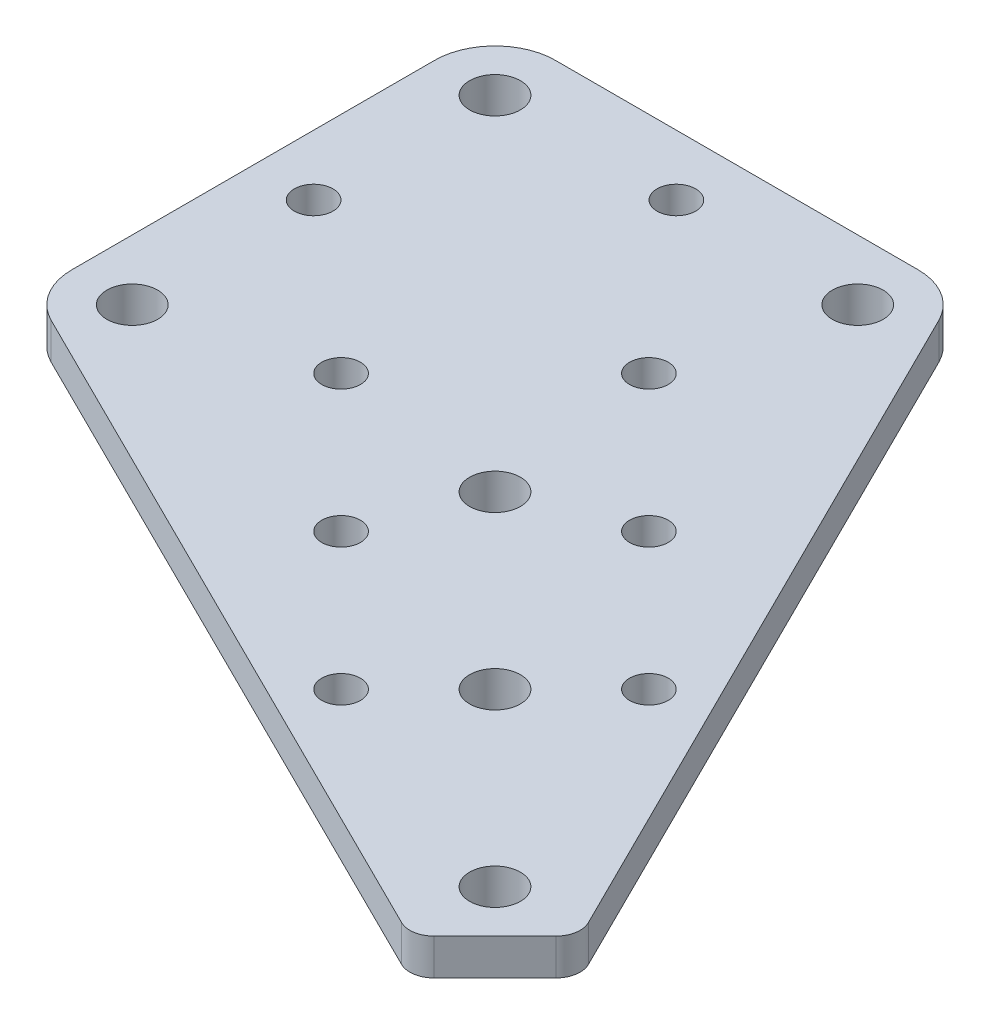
ISO-10303-21;
HEADER;
FILE_DESCRIPTION(('STEP AP214'),'2;1');
FILE_NAME('part.step','',(''),(''),'','','');
FILE_SCHEMA(('AUTOMOTIVE_DESIGN { 1 0 10303 214 1 1 1 1 }'));
ENDSEC;
DATA;
#1=APPLICATION_CONTEXT('core data for automotive mechanical design processes');
#2=APPLICATION_PROTOCOL_DEFINITION('international standard','automotive_design',2000,#1);
#3=PRODUCT_CONTEXT('',#1,'mechanical');
#4=PRODUCT('Part','Part','',(#3));
#5=PRODUCT_RELATED_PRODUCT_CATEGORY('part','',(#4));
#6=PRODUCT_DEFINITION_FORMATION('','',#4);
#7=PRODUCT_DEFINITION_CONTEXT('part definition',#1,'design');
#8=PRODUCT_DEFINITION('design','',#6,#7);
#9=PRODUCT_DEFINITION_SHAPE('','',#8);
#10=(LENGTH_UNIT() NAMED_UNIT(*) SI_UNIT(.MILLI.,.METRE.));
#11=(NAMED_UNIT(*) PLANE_ANGLE_UNIT() SI_UNIT($,.RADIAN.));
#12=(NAMED_UNIT(*) SI_UNIT($,.STERADIAN.) SOLID_ANGLE_UNIT());
#13=UNCERTAINTY_MEASURE_WITH_UNIT(LENGTH_MEASURE(1.E-05),#10,'distance_accuracy_value','');
#14=(GEOMETRIC_REPRESENTATION_CONTEXT(3) GLOBAL_UNCERTAINTY_ASSIGNED_CONTEXT((#13)) GLOBAL_UNIT_ASSIGNED_CONTEXT((#10,
#11,#12)) REPRESENTATION_CONTEXT('',''));
#15=CARTESIAN_POINT('',(0.,0.,0.));
#16=DIRECTION('',(0.,0.,1.));
#17=DIRECTION('',(1.,0.,0.));
#18=AXIS2_PLACEMENT_3D('',#15,#16,#17);
#19=CARTESIAN_POINT('',(13.,3.,43.));
#20=DIRECTION('',(0.,1.,0.));
#21=DIRECTION('',(0.,0.,1.));
#22=AXIS2_PLACEMENT_3D('',#19,#20,#21);
#23=PLANE('',#22);
#24=CARTESIAN_POINT('',(39.2821792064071,3.,26.5542571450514));
#25=DIRECTION('',(0.,1.,0.));
#26=DIRECTION('',(0.,0.,1.));
#27=AXIS2_PLACEMENT_3D('',#24,#25,#26);
#28=CIRCLE('',#27,1.6);
#29=CARTESIAN_POINT('',(39.2821792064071,3.,28.1542571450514));
#30=VERTEX_POINT('',#29);
#31=EDGE_CURVE('E432',#30,#30,#28,.T.);
#32=ORIENTED_EDGE('',*,*,#31,.F.);
#33=EDGE_LOOP('',(#32));
#34=FACE_BOUND('',#33,.T.);
#35=CARTESIAN_POINT('',(26.5542571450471,3.,39.2821792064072));
#36=DIRECTION('',(0.,1.,0.));
#37=DIRECTION('',(0.,0.,1.));
#38=AXIS2_PLACEMENT_3D('',#35,#36,#37);
#39=CIRCLE('',#38,1.6);
#40=CARTESIAN_POINT('',(26.5542571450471,3.,40.8821792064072));
#41=VERTEX_POINT('',#40);
#42=EDGE_CURVE('E452',#41,#41,#39,.T.);
#43=ORIENTED_EDGE('',*,*,#42,.F.);
#44=EDGE_LOOP('',(#43));
#45=FACE_BOUND('',#44,.T.);
#46=CARTESIAN_POINT('',(13.,3.,13.));
#47=DIRECTION('',(0.,1.,0.));
#48=DIRECTION('',(0.,0.,1.));
#49=AXIS2_PLACEMENT_3D('',#46,#47,#48);
#50=CIRCLE('',#49,2.1);
#51=CARTESIAN_POINT('',(13.,3.,15.1));
#52=VERTEX_POINT('',#51);
#53=EDGE_CURVE('E464',#52,#52,#50,.T.);
#54=ORIENTED_EDGE('',*,*,#53,.F.);
#55=EDGE_LOOP('',(#54));
#56=FACE_BOUND('',#55,.T.);
#57=CARTESIAN_POINT('',(55.5456351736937,3.,55.545635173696));
#58=DIRECTION('',(0.,1.,0.));
#59=DIRECTION('',(0.,0.,1.));
#60=AXIS2_PLACEMENT_3D('',#57,#58,#59);
#61=CIRCLE('',#60,2.10000000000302);
#62=CARTESIAN_POINT('',(55.5456351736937,3.,57.645635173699));
#63=VERTEX_POINT('',#62);
#64=EDGE_CURVE('E476',#63,#63,#61,.T.);
#65=ORIENTED_EDGE('',*,*,#64,.F.);
#66=EDGE_LOOP('',(#65));
#67=FACE_BOUND('',#66,.T.);
#68=CARTESIAN_POINT('',(49.1816741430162,3.,61.909596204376));
#69=DIRECTION('',(0.,1.,0.));
#70=DIRECTION('',(0.,0.,1.));
#71=AXIS2_PLACEMENT_3D('',#68,#69,#70);
#72=CIRCLE('',#71,1.60000000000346);
#73=CARTESIAN_POINT('',(49.1816741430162,3.,63.5095962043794));
#74=VERTEX_POINT('',#73);
#75=EDGE_CURVE('E488',#74,#74,#72,.T.);
#76=ORIENTED_EDGE('',*,*,#75,.F.);
#77=EDGE_LOOP('',(#76));
#78=FACE_BOUND('',#77,.T.);
#79=CARTESIAN_POINT('',(13.,3.,43.));
#80=DIRECTION('',(0.,1.,0.));
#81=DIRECTION('',(0.,0.,1.));
#82=AXIS2_PLACEMENT_3D('',#79,#80,#81);
#83=CIRCLE('',#82,2.1);
#84=CARTESIAN_POINT('',(13.,3.,45.1));
#85=VERTEX_POINT('',#84);
#86=EDGE_CURVE('E500',#85,#85,#83,.T.);
#87=ORIENTED_EDGE('',*,*,#86,.F.);
#88=EDGE_LOOP('',(#87));
#89=FACE_BOUND('',#88,.T.);
#90=CARTESIAN_POINT('',(43.,3.,13.));
#91=DIRECTION('',(0.,1.,0.));
#92=DIRECTION('',(0.,0.,1.));
#93=AXIS2_PLACEMENT_3D('',#90,#91,#92);
#94=CIRCLE('',#93,2.1);
#95=CARTESIAN_POINT('',(43.,3.,15.1));
#96=VERTEX_POINT('',#95);
#97=EDGE_CURVE('E160',#96,#96,#94,.T.);
#98=ORIENTED_EDGE('',*,*,#97,.F.);
#99=EDGE_LOOP('',(#98));
#100=FACE_BOUND('',#99,.T.);
#101=DIRECTION('',(0.707106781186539,0.,-0.707106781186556));
#102=VECTOR('',#101,1.);
#103=CARTESIAN_POINT('',(76.7588386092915,3.,69.6877707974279));
#104=LINE('',#103,#102);
#105=CARTESIAN_POINT('',(70.7045211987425,3.,75.7420882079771));
#106=VERTEX_POINT('',#105);
#107=CARTESIAN_POINT('',(75.7420882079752,3.,70.7045211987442));
#108=VERTEX_POINT('',#107);
#109=EDGE_CURVE('E129',#106,#108,#104,.T.);
#110=ORIENTED_EDGE('',*,*,#109,.T.);
#111=CARTESIAN_POINT('',(74.3278746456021,3.,69.2903076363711));
#112=DIRECTION('',(0.,1.,0.));
#113=DIRECTION('',(0.,0.,1.));
#114=AXIS2_PLACEMENT_3D('',#111,#112,#113);
#115=CIRCLE('',#114,2.);
#116=CARTESIAN_POINT('',(76.1188544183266,3.,68.4001439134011));
#117=VERTEX_POINT('',#116);
#118=EDGE_CURVE('E49',#108,#117,#115,.T.);
#119=ORIENTED_EDGE('',*,*,#118,.T.);
#120=DIRECTION('',(-0.445081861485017,0.,-0.895489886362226));
#121=VECTOR('',#120,1.);
#122=CARTESIAN_POINT('',(47.4774494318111,3.,10.7745906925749));
#123=LINE('',#122,#121);
#124=CARTESIAN_POINT('',(47.4774494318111,3.,10.7745906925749));
#125=VERTEX_POINT('',#124);
#126=EDGE_CURVE('E119',#117,#125,#123,.T.);
#127=ORIENTED_EDGE('',*,*,#126,.T.);
#128=CARTESIAN_POINT('',(43.,3.,13.));
#129=DIRECTION('',(0.,1.,0.));
#130=DIRECTION('',(0.,0.,-1.));
#131=AXIS2_PLACEMENT_3D('',#128,#129,#130);
#132=CIRCLE('',#131,5.);
#133=CARTESIAN_POINT('',(43.,3.,8.));
#134=VERTEX_POINT('',#133);
#135=EDGE_CURVE('E123',#125,#134,#132,.T.);
#136=ORIENTED_EDGE('',*,*,#135,.T.);
#137=DIRECTION('',(-1.,0.,0.));
#138=VECTOR('',#137,1.);
#139=CARTESIAN_POINT('',(13.,3.,8.));
#140=LINE('',#139,#138);
#141=CARTESIAN_POINT('',(13.,3.,8.));
#142=VERTEX_POINT('',#141);
#143=EDGE_CURVE('E144',#134,#142,#140,.T.);
#144=ORIENTED_EDGE('',*,*,#143,.T.);
#145=CARTESIAN_POINT('',(13.,3.,13.));
#146=DIRECTION('',(0.,1.,0.));
#147=DIRECTION('',(0.,0.,-1.));
#148=AXIS2_PLACEMENT_3D('',#145,#146,#147);
#149=CIRCLE('',#148,5.);
#150=CARTESIAN_POINT('',(8.00000000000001,3.,13.));
#151=VERTEX_POINT('',#150);
#152=EDGE_CURVE('E146',#142,#151,#149,.T.);
#153=ORIENTED_EDGE('',*,*,#152,.T.);
#154=DIRECTION('',(0.,0.,1.));
#155=VECTOR('',#154,1.);
#156=CARTESIAN_POINT('',(8.,3.,43.));
#157=LINE('',#156,#155);
#158=CARTESIAN_POINT('',(8.,3.,43.));
#159=VERTEX_POINT('',#158);
#160=EDGE_CURVE('E151',#151,#159,#157,.T.);
#161=ORIENTED_EDGE('',*,*,#160,.T.);
#162=CARTESIAN_POINT('',(13.,3.,43.));
#163=DIRECTION('',(0.,1.,0.));
#164=DIRECTION('',(0.,0.,1.));
#165=AXIS2_PLACEMENT_3D('',#162,#163,#164);
#166=CIRCLE('',#165,5.00000000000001);
#167=CARTESIAN_POINT('',(10.7745906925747,3.,47.4774494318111));
#168=VERTEX_POINT('',#167);
#169=EDGE_CURVE('E153',#159,#168,#166,.T.);
#170=ORIENTED_EDGE('',*,*,#169,.T.);
#171=DIRECTION('',(0.895489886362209,0.,0.445081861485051));
#172=VECTOR('',#171,1.);
#173=CARTESIAN_POINT('',(69.6877707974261,3.,76.7588386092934));
#174=LINE('',#173,#172);
#175=CARTESIAN_POINT('',(68.4001439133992,3.,76.1188544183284));
#176=VERTEX_POINT('',#175);
#177=EDGE_CURVE('E155',#168,#176,#174,.T.);
#178=ORIENTED_EDGE('',*,*,#177,.T.);
#179=CARTESIAN_POINT('',(69.2903076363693,3.,74.327874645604));
#180=DIRECTION('',(0.,1.,0.));
#181=DIRECTION('',(0.,0.,1.));
#182=AXIS2_PLACEMENT_3D('',#179,#180,#181);
#183=CIRCLE('',#182,2.);
#184=EDGE_CURVE('E195',#176,#106,#183,.T.);
#185=ORIENTED_EDGE('',*,*,#184,.T.);
#186=EDGE_LOOP('',(#110,#119,#127,#136,#144,#153,#161,#170,#178,#185));
#187=FACE_BOUND('',#186,.T.);
#188=CARTESIAN_POINT('',(28.,3.,13.));
#189=DIRECTION('',(0.,1.,0.));
#190=DIRECTION('',(0.,0.,1.));
#191=AXIS2_PLACEMENT_3D('',#188,#189,#190);
#192=CIRCLE('',#191,1.6);
#193=CARTESIAN_POINT('',(28.,3.,14.6));
#194=VERTEX_POINT('',#193);
#195=EDGE_CURVE('E506',#194,#194,#192,.T.);
#196=ORIENTED_EDGE('',*,*,#195,.F.);
#197=EDGE_LOOP('',(#196));
#198=FACE_BOUND('',#197,.T.);
#199=CARTESIAN_POINT('',(13.,3.,28.));
#200=DIRECTION('',(0.,1.,0.));
#201=DIRECTION('',(0.,0.,1.));
#202=AXIS2_PLACEMENT_3D('',#199,#200,#201);
#203=CIRCLE('',#202,1.6);
#204=CARTESIAN_POINT('',(13.,3.,29.6));
#205=VERTEX_POINT('',#204);
#206=EDGE_CURVE('E494',#205,#205,#203,.T.);
#207=ORIENTED_EDGE('',*,*,#206,.F.);
#208=EDGE_LOOP('',(#207));
#209=FACE_BOUND('',#208,.T.);
#210=CARTESIAN_POINT('',(41.4034995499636,3.,41.4034995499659));
#211=DIRECTION('',(0.,1.,0.));
#212=DIRECTION('',(0.,0.,1.));
#213=AXIS2_PLACEMENT_3D('',#210,#211,#212);
#214=CIRCLE('',#213,2.10000000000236);
#215=CARTESIAN_POINT('',(41.4034995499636,3.,43.5034995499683));
#216=VERTEX_POINT('',#215);
#217=EDGE_CURVE('E482',#216,#216,#214,.T.);
#218=ORIENTED_EDGE('',*,*,#217,.F.);
#219=EDGE_LOOP('',(#218));
#220=FACE_BOUND('',#219,.T.);
#221=CARTESIAN_POINT('',(69.6877707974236,3.,69.6877707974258));
#222=DIRECTION('',(0.,1.,0.));
#223=DIRECTION('',(0.,0.,1.));
#224=AXIS2_PLACEMENT_3D('',#221,#222,#223);
#225=CIRCLE('',#224,2.10000000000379);
#226=CARTESIAN_POINT('',(69.6877707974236,3.,71.7877707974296));
#227=VERTEX_POINT('',#226);
#228=EDGE_CURVE('E470',#227,#227,#225,.T.);
#229=ORIENTED_EDGE('',*,*,#228,.F.);
#230=EDGE_LOOP('',(#229));
#231=FACE_BOUND('',#230,.T.);
#232=CARTESIAN_POINT('',(37.8679656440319,3.,50.5958877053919));
#233=DIRECTION('',(0.,1.,0.));
#234=DIRECTION('',(0.,0.,1.));
#235=AXIS2_PLACEMENT_3D('',#232,#233,#234);
#236=CIRCLE('',#235,1.6);
#237=CARTESIAN_POINT('',(37.8679656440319,3.,52.1958877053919));
#238=VERTEX_POINT('',#237);
#239=EDGE_CURVE('E458',#238,#238,#236,.T.);
#240=ORIENTED_EDGE('',*,*,#239,.F.);
#241=EDGE_LOOP('',(#240));
#242=FACE_BOUND('',#241,.T.);
#243=CARTESIAN_POINT('',(50.595887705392,3.,37.8679656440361));
#244=DIRECTION('',(0.,1.,0.));
#245=DIRECTION('',(0.,0.,1.));
#246=AXIS2_PLACEMENT_3D('',#243,#244,#245);
#247=CIRCLE('',#246,1.6);
#248=CARTESIAN_POINT('',(50.595887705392,3.,39.4679656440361));
#249=VERTEX_POINT('',#248);
#250=EDGE_CURVE('E446',#249,#249,#247,.T.);
#251=ORIENTED_EDGE('',*,*,#250,.F.);
#252=EDGE_LOOP('',(#251));
#253=FACE_BOUND('',#252,.T.);
#254=CARTESIAN_POINT('',(61.909596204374,3.,49.1816741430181));
#255=DIRECTION('',(0.,1.,0.));
#256=DIRECTION('',(0.,0.,1.));
#257=AXIS2_PLACEMENT_3D('',#254,#255,#256);
#258=CIRCLE('',#257,1.60000000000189);
#259=CARTESIAN_POINT('',(61.909596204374,3.,50.78167414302));
#260=VERTEX_POINT('',#259);
#261=EDGE_CURVE('E437',#260,#260,#258,.T.);
#262=ORIENTED_EDGE('',*,*,#261,.F.);
#263=EDGE_LOOP('',(#262));
#264=FACE_BOUND('',#263,.T.);
#265=ADVANCED_FACE('F41',(#34,#45,#56,#67,#78,#89,#100,#187,#198,#209,#220,#231,#242,#253,#264),
#23,.T.);
#266=CARTESIAN_POINT('',(13.,0.,43.));
#267=DIRECTION('',(0.,1.,0.));
#268=DIRECTION('',(0.,0.,1.));
#269=AXIS2_PLACEMENT_3D('',#266,#267,#268);
#270=PLANE('',#269);
#271=DIRECTION('',(-0.445081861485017,0.,-0.895489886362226));
#272=VECTOR('',#271,1.);
#273=CARTESIAN_POINT('',(47.4774494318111,0.,10.7745906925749));
#274=LINE('',#273,#272);
#275=CARTESIAN_POINT('',(76.1188544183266,0.,68.4001439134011));
#276=VERTEX_POINT('',#275);
#277=CARTESIAN_POINT('',(47.4774494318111,0.,10.7745906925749));
#278=VERTEX_POINT('',#277);
#279=EDGE_CURVE('E135',#276,#278,#274,.T.);
#280=ORIENTED_EDGE('',*,*,#279,.F.);
#281=CARTESIAN_POINT('',(74.3278746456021,0.,69.2903076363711));
#282=DIRECTION('',(0.,1.,0.));
#283=DIRECTION('',(0.,0.,1.));
#284=AXIS2_PLACEMENT_3D('',#281,#282,#283);
#285=CIRCLE('',#284,2.);
#286=CARTESIAN_POINT('',(75.7420882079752,0.,70.7045211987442));
#287=VERTEX_POINT('',#286);
#288=EDGE_CURVE('E189',#276,#287,#285,.F.);
#289=ORIENTED_EDGE('',*,*,#288,.T.);
#290=DIRECTION('',(0.707106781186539,0.,-0.707106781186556));
#291=VECTOR('',#290,1.);
#292=CARTESIAN_POINT('',(76.7588386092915,0.,69.6877707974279));
#293=LINE('',#292,#291);
#294=CARTESIAN_POINT('',(70.7045211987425,0.,75.7420882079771));
#295=VERTEX_POINT('',#294);
#296=EDGE_CURVE('E158',#295,#287,#293,.T.);
#297=ORIENTED_EDGE('',*,*,#296,.F.);
#298=CARTESIAN_POINT('',(69.2903076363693,0.,74.327874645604));
#299=DIRECTION('',(0.,1.,0.));
#300=DIRECTION('',(0.,0.,1.));
#301=AXIS2_PLACEMENT_3D('',#298,#299,#300);
#302=CIRCLE('',#301,2.);
#303=CARTESIAN_POINT('',(68.4001439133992,0.,76.1188544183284));
#304=VERTEX_POINT('',#303);
#305=EDGE_CURVE('E187',#295,#304,#302,.F.);
#306=ORIENTED_EDGE('',*,*,#305,.T.);
#307=DIRECTION('',(0.895489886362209,0.,0.445081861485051));
#308=VECTOR('',#307,1.);
#309=CARTESIAN_POINT('',(69.6877707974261,0.,76.7588386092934));
#310=LINE('',#309,#308);
#311=CARTESIAN_POINT('',(10.7745906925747,0.,47.4774494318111));
#312=VERTEX_POINT('',#311);
#313=EDGE_CURVE('E172',#312,#304,#310,.T.);
#314=ORIENTED_EDGE('',*,*,#313,.F.);
#315=CARTESIAN_POINT('',(13.,0.,43.));
#316=DIRECTION('',(0.,1.,0.));
#317=DIRECTION('',(0.,0.,1.));
#318=AXIS2_PLACEMENT_3D('',#315,#316,#317);
#319=CIRCLE('',#318,5.00000000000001);
#320=CARTESIAN_POINT('',(8.,0.,43.));
#321=VERTEX_POINT('',#320);
#322=EDGE_CURVE('E170',#321,#312,#319,.T.);
#323=ORIENTED_EDGE('',*,*,#322,.F.);
#324=DIRECTION('',(0.,0.,1.));
#325=VECTOR('',#324,1.);
#326=CARTESIAN_POINT('',(8.,0.,43.));
#327=LINE('',#326,#325);
#328=CARTESIAN_POINT('',(8.00000000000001,0.,13.));
#329=VERTEX_POINT('',#328);
#330=EDGE_CURVE('E168',#329,#321,#327,.T.);
#331=ORIENTED_EDGE('',*,*,#330,.F.);
#332=CARTESIAN_POINT('',(13.,0.,13.));
#333=DIRECTION('',(0.,1.,0.));
#334=DIRECTION('',(0.,0.,-1.));
#335=AXIS2_PLACEMENT_3D('',#332,#333,#334);
#336=CIRCLE('',#335,5.);
#337=CARTESIAN_POINT('',(13.,0.,8.));
#338=VERTEX_POINT('',#337);
#339=EDGE_CURVE('E166',#338,#329,#336,.T.);
#340=ORIENTED_EDGE('',*,*,#339,.F.);
#341=DIRECTION('',(-1.,0.,0.));
#342=VECTOR('',#341,1.);
#343=CARTESIAN_POINT('',(13.,0.,8.));
#344=LINE('',#343,#342);
#345=CARTESIAN_POINT('',(43.,0.,8.));
#346=VERTEX_POINT('',#345);
#347=EDGE_CURVE('E164',#346,#338,#344,.T.);
#348=ORIENTED_EDGE('',*,*,#347,.F.);
#349=CARTESIAN_POINT('',(43.,0.,13.));
#350=DIRECTION('',(0.,1.,0.));
#351=DIRECTION('',(0.,0.,-1.));
#352=AXIS2_PLACEMENT_3D('',#349,#350,#351);
#353=CIRCLE('',#352,5.);
#354=EDGE_CURVE('E162',#278,#346,#353,.T.);
#355=ORIENTED_EDGE('',*,*,#354,.F.);
#356=EDGE_LOOP('',(#280,#289,#297,#306,#314,#323,#331,#340,#348,#355));
#357=FACE_BOUND('',#356,.T.);
#358=CARTESIAN_POINT('',(43.,0.,13.));
#359=DIRECTION('',(0.,1.,0.));
#360=DIRECTION('',(0.,0.,1.));
#361=AXIS2_PLACEMENT_3D('',#358,#359,#360);
#362=CIRCLE('',#361,2.1);
#363=CARTESIAN_POINT('',(43.,0.,15.1));
#364=VERTEX_POINT('',#363);
#365=EDGE_CURVE('E509',#364,#364,#362,.T.);
#366=ORIENTED_EDGE('',*,*,#365,.T.);
#367=EDGE_LOOP('',(#366));
#368=FACE_BOUND('',#367,.T.);
#369=CARTESIAN_POINT('',(28.,0.,13.));
#370=DIRECTION('',(0.,1.,0.));
#371=DIRECTION('',(0.,0.,1.));
#372=AXIS2_PLACEMENT_3D('',#369,#370,#371);
#373=CIRCLE('',#372,1.6);
#374=CARTESIAN_POINT('',(28.,0.,14.6));
#375=VERTEX_POINT('',#374);
#376=EDGE_CURVE('E503',#375,#375,#373,.T.);
#377=ORIENTED_EDGE('',*,*,#376,.T.);
#378=EDGE_LOOP('',(#377));
#379=FACE_BOUND('',#378,.T.);
#380=CARTESIAN_POINT('',(13.,0.,43.));
#381=DIRECTION('',(0.,1.,0.));
#382=DIRECTION('',(0.,0.,1.));
#383=AXIS2_PLACEMENT_3D('',#380,#381,#382);
#384=CIRCLE('',#383,2.1);
#385=CARTESIAN_POINT('',(13.,0.,45.1));
#386=VERTEX_POINT('',#385);
#387=EDGE_CURVE('E497',#386,#386,#384,.T.);
#388=ORIENTED_EDGE('',*,*,#387,.T.);
#389=EDGE_LOOP('',(#388));
#390=FACE_BOUND('',#389,.T.);
#391=CARTESIAN_POINT('',(13.,0.,28.));
#392=DIRECTION('',(0.,1.,0.));
#393=DIRECTION('',(0.,0.,1.));
#394=AXIS2_PLACEMENT_3D('',#391,#392,#393);
#395=CIRCLE('',#394,1.6);
#396=CARTESIAN_POINT('',(13.,0.,29.6));
#397=VERTEX_POINT('',#396);
#398=EDGE_CURVE('E491',#397,#397,#395,.T.);
#399=ORIENTED_EDGE('',*,*,#398,.T.);
#400=EDGE_LOOP('',(#399));
#401=FACE_BOUND('',#400,.T.);
#402=CARTESIAN_POINT('',(49.1816741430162,0.,61.909596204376));
#403=DIRECTION('',(0.,1.,0.));
#404=DIRECTION('',(0.,0.,1.));
#405=AXIS2_PLACEMENT_3D('',#402,#403,#404);
#406=CIRCLE('',#405,1.60000000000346);
#407=CARTESIAN_POINT('',(49.1816741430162,0.,63.5095962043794));
#408=VERTEX_POINT('',#407);
#409=EDGE_CURVE('E485',#408,#408,#406,.T.);
#410=ORIENTED_EDGE('',*,*,#409,.T.);
#411=EDGE_LOOP('',(#410));
#412=FACE_BOUND('',#411,.T.);
#413=CARTESIAN_POINT('',(41.4034995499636,0.,41.4034995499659));
#414=DIRECTION('',(0.,1.,0.));
#415=DIRECTION('',(0.,0.,1.));
#416=AXIS2_PLACEMENT_3D('',#413,#414,#415);
#417=CIRCLE('',#416,2.10000000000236);
#418=CARTESIAN_POINT('',(41.4034995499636,0.,43.5034995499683));
#419=VERTEX_POINT('',#418);
#420=EDGE_CURVE('E479',#419,#419,#417,.T.);
#421=ORIENTED_EDGE('',*,*,#420,.T.);
#422=EDGE_LOOP('',(#421));
#423=FACE_BOUND('',#422,.T.);
#424=CARTESIAN_POINT('',(55.5456351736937,0.,55.545635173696));
#425=DIRECTION('',(0.,1.,0.));
#426=DIRECTION('',(0.,0.,1.));
#427=AXIS2_PLACEMENT_3D('',#424,#425,#426);
#428=CIRCLE('',#427,2.10000000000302);
#429=CARTESIAN_POINT('',(55.5456351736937,0.,57.645635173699));
#430=VERTEX_POINT('',#429);
#431=EDGE_CURVE('E473',#430,#430,#428,.T.);
#432=ORIENTED_EDGE('',*,*,#431,.T.);
#433=EDGE_LOOP('',(#432));
#434=FACE_BOUND('',#433,.T.);
#435=CARTESIAN_POINT('',(69.6877707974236,0.,69.6877707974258));
#436=DIRECTION('',(0.,1.,0.));
#437=DIRECTION('',(0.,0.,1.));
#438=AXIS2_PLACEMENT_3D('',#435,#436,#437);
#439=CIRCLE('',#438,2.10000000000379);
#440=CARTESIAN_POINT('',(69.6877707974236,0.,71.7877707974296));
#441=VERTEX_POINT('',#440);
#442=EDGE_CURVE('E467',#441,#441,#439,.T.);
#443=ORIENTED_EDGE('',*,*,#442,.T.);
#444=EDGE_LOOP('',(#443));
#445=FACE_BOUND('',#444,.T.);
#446=CARTESIAN_POINT('',(13.,0.,13.));
#447=DIRECTION('',(0.,1.,0.));
#448=DIRECTION('',(0.,0.,1.));
#449=AXIS2_PLACEMENT_3D('',#446,#447,#448);
#450=CIRCLE('',#449,2.1);
#451=CARTESIAN_POINT('',(13.,0.,15.1));
#452=VERTEX_POINT('',#451);
#453=EDGE_CURVE('E461',#452,#452,#450,.T.);
#454=ORIENTED_EDGE('',*,*,#453,.T.);
#455=EDGE_LOOP('',(#454));
#456=FACE_BOUND('',#455,.T.);
#457=CARTESIAN_POINT('',(37.8679656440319,0.,50.5958877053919));
#458=DIRECTION('',(0.,1.,0.));
#459=DIRECTION('',(0.,0.,1.));
#460=AXIS2_PLACEMENT_3D('',#457,#458,#459);
#461=CIRCLE('',#460,1.6);
#462=CARTESIAN_POINT('',(37.8679656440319,0.,52.1958877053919));
#463=VERTEX_POINT('',#462);
#464=EDGE_CURVE('E455',#463,#463,#461,.T.);
#465=ORIENTED_EDGE('',*,*,#464,.T.);
#466=EDGE_LOOP('',(#465));
#467=FACE_BOUND('',#466,.T.);
#468=CARTESIAN_POINT('',(26.5542571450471,0.,39.2821792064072));
#469=DIRECTION('',(0.,1.,0.));
#470=DIRECTION('',(0.,0.,1.));
#471=AXIS2_PLACEMENT_3D('',#468,#469,#470);
#472=CIRCLE('',#471,1.6);
#473=CARTESIAN_POINT('',(26.5542571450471,0.,40.8821792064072));
#474=VERTEX_POINT('',#473);
#475=EDGE_CURVE('E449',#474,#474,#472,.T.);
#476=ORIENTED_EDGE('',*,*,#475,.T.);
#477=EDGE_LOOP('',(#476));
#478=FACE_BOUND('',#477,.T.);
#479=CARTESIAN_POINT('',(50.595887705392,0.,37.8679656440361));
#480=DIRECTION('',(0.,1.,0.));
#481=DIRECTION('',(0.,0.,1.));
#482=AXIS2_PLACEMENT_3D('',#479,#480,#481);
#483=CIRCLE('',#482,1.6);
#484=CARTESIAN_POINT('',(50.595887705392,0.,39.4679656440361));
#485=VERTEX_POINT('',#484);
#486=EDGE_CURVE('E439',#485,#485,#483,.T.);
#487=ORIENTED_EDGE('',*,*,#486,.T.);
#488=EDGE_LOOP('',(#487));
#489=FACE_BOUND('',#488,.T.);
#490=CARTESIAN_POINT('',(39.2821792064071,0.,26.5542571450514));
#491=DIRECTION('',(0.,1.,0.));
#492=DIRECTION('',(0.,0.,1.));
#493=AXIS2_PLACEMENT_3D('',#490,#491,#492);
#494=CIRCLE('',#493,1.6);
#495=CARTESIAN_POINT('',(39.2821792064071,0.,28.1542571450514));
#496=VERTEX_POINT('',#495);
#497=EDGE_CURVE('E435',#496,#496,#494,.T.);
#498=ORIENTED_EDGE('',*,*,#497,.T.);
#499=EDGE_LOOP('',(#498));
#500=FACE_BOUND('',#499,.T.);
#501=CARTESIAN_POINT('',(61.909596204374,0.,49.1816741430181));
#502=DIRECTION('',(0.,1.,0.));
#503=DIRECTION('',(0.,0.,1.));
#504=AXIS2_PLACEMENT_3D('',#501,#502,#503);
#505=CIRCLE('',#504,1.60000000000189);
#506=CARTESIAN_POINT('',(61.909596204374,0.,50.78167414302));
#507=VERTEX_POINT('',#506);
#508=EDGE_CURVE('E442',#507,#507,#505,.T.);
#509=ORIENTED_EDGE('',*,*,#508,.T.);
#510=EDGE_LOOP('',(#509));
#511=FACE_BOUND('',#510,.T.);
#512=ADVANCED_FACE('F203',(#357,#368,#379,#390,#401,#412,#423,#434,#445,#456,#467,#478,#489,
#500,#511),#270,.F.);
#513=CARTESIAN_POINT('',(76.7588386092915,3.,69.6877707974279));
#514=DIRECTION('',(-0.707106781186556,0.,-0.707106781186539));
#515=DIRECTION('',(-0.707106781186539,0.,0.707106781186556));
#516=AXIS2_PLACEMENT_3D('',#513,#514,#515);
#517=PLANE('',#516);
#518=ORIENTED_EDGE('',*,*,#296,.T.);
#519=DIRECTION('',(0.,-1.,0.));
#520=VECTOR('',#519,1.);
#521=CARTESIAN_POINT('',(75.7420882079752,3.,70.7045211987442));
#522=LINE('',#521,#520);
#523=EDGE_CURVE('E62',#287,#108,#522,.F.);
#524=ORIENTED_EDGE('',*,*,#523,.T.);
#525=ORIENTED_EDGE('',*,*,#109,.F.);
#526=DIRECTION('',(0.,-1.,0.));
#527=VECTOR('',#526,1.);
#528=CARTESIAN_POINT('',(70.7045211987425,3.,75.7420882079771));
#529=LINE('',#528,#527);
#530=EDGE_CURVE('E191',#106,#295,#529,.T.);
#531=ORIENTED_EDGE('',*,*,#530,.T.);
#532=EDGE_LOOP('',(#518,#524,#525,#531));
#533=FACE_BOUND('',#532,.T.);
#534=ADVANCED_FACE('F199',(#533),#517,.F.);
#535=CARTESIAN_POINT('',(47.4774494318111,3.,10.7745906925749));
#536=DIRECTION('',(-0.895489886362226,0.,0.445081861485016));
#537=DIRECTION('',(0.445081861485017,0.,0.895489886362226));
#538=AXIS2_PLACEMENT_3D('',#535,#536,#537);
#539=PLANE('',#538);
#540=ORIENTED_EDGE('',*,*,#126,.F.);
#541=DIRECTION('',(0.,-1.,0.));
#542=VECTOR('',#541,1.);
#543=CARTESIAN_POINT('',(76.1188544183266,3.,68.4001439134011));
#544=LINE('',#543,#542);
#545=EDGE_CURVE('E138',#117,#276,#544,.T.);
#546=ORIENTED_EDGE('',*,*,#545,.T.);
#547=ORIENTED_EDGE('',*,*,#279,.T.);
#548=DIRECTION('',(0.,-1.,0.));
#549=VECTOR('',#548,1.);
#550=CARTESIAN_POINT('',(47.4774494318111,3.,10.7745906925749));
#551=LINE('',#550,#549);
#552=EDGE_CURVE('E132',#125,#278,#551,.T.);
#553=ORIENTED_EDGE('',*,*,#552,.F.);
#554=EDGE_LOOP('',(#540,#546,#547,#553));
#555=FACE_BOUND('',#554,.T.);
#556=ADVANCED_FACE('F133',(#555),#539,.F.);
#557=CARTESIAN_POINT('',(43.,3.,13.));
#558=DIRECTION('',(0.,-1.,0.));
#559=DIRECTION('',(0.,0.,-1.));
#560=AXIS2_PLACEMENT_3D('',#557,#558,#559);
#561=CYLINDRICAL_SURFACE('',#560,5.);
#562=ORIENTED_EDGE('',*,*,#354,.T.);
#563=DIRECTION('',(0.,-1.,0.));
#564=VECTOR('',#563,1.);
#565=CARTESIAN_POINT('',(43.,3.,8.));
#566=LINE('',#565,#564);
#567=EDGE_CURVE('E139',#134,#346,#566,.T.);
#568=ORIENTED_EDGE('',*,*,#567,.F.);
#569=ORIENTED_EDGE('',*,*,#135,.F.);
#570=ORIENTED_EDGE('',*,*,#552,.T.);
#571=EDGE_LOOP('',(#562,#568,#569,#570));
#572=FACE_BOUND('',#571,.T.);
#573=ADVANCED_FACE('F141',(#572),#561,.T.);
#574=CARTESIAN_POINT('',(13.,3.,8.));
#575=DIRECTION('',(0.,0.,1.));
#576=DIRECTION('',(1.,0.,0.));
#577=AXIS2_PLACEMENT_3D('',#574,#575,#576);
#578=PLANE('',#577);
#579=ORIENTED_EDGE('',*,*,#347,.T.);
#580=DIRECTION('',(0.,-1.,0.));
#581=VECTOR('',#580,1.);
#582=CARTESIAN_POINT('',(13.,3.,8.));
#583=LINE('',#582,#581);
#584=EDGE_CURVE('E182',#142,#338,#583,.T.);
#585=ORIENTED_EDGE('',*,*,#584,.F.);
#586=ORIENTED_EDGE('',*,*,#143,.F.);
#587=ORIENTED_EDGE('',*,*,#567,.T.);
#588=EDGE_LOOP('',(#579,#585,#586,#587));
#589=FACE_BOUND('',#588,.T.);
#590=ADVANCED_FACE('F224',(#589),#578,.F.);
#591=CARTESIAN_POINT('',(13.,3.,13.));
#592=DIRECTION('',(0.,-1.,0.));
#593=DIRECTION('',(0.,0.,-1.));
#594=AXIS2_PLACEMENT_3D('',#591,#592,#593);
#595=CYLINDRICAL_SURFACE('',#594,5.);
#596=ORIENTED_EDGE('',*,*,#339,.T.);
#597=DIRECTION('',(0.,-1.,0.));
#598=VECTOR('',#597,1.);
#599=CARTESIAN_POINT('',(8.00000000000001,3.,13.));
#600=LINE('',#599,#598);
#601=EDGE_CURVE('E179',#151,#329,#600,.T.);
#602=ORIENTED_EDGE('',*,*,#601,.F.);
#603=ORIENTED_EDGE('',*,*,#152,.F.);
#604=ORIENTED_EDGE('',*,*,#584,.T.);
#605=EDGE_LOOP('',(#596,#602,#603,#604));
#606=FACE_BOUND('',#605,.T.);
#607=ADVANCED_FACE('F221',(#606),#595,.T.);
#608=CARTESIAN_POINT('',(8.,3.,43.));
#609=DIRECTION('',(1.,0.,0.));
#610=DIRECTION('',(0.,0.,-1.));
#611=AXIS2_PLACEMENT_3D('',#608,#609,#610);
#612=PLANE('',#611);
#613=ORIENTED_EDGE('',*,*,#330,.T.);
#614=DIRECTION('',(0.,-1.,0.));
#615=VECTOR('',#614,1.);
#616=CARTESIAN_POINT('',(8.,3.,43.));
#617=LINE('',#616,#615);
#618=EDGE_CURVE('E176',#159,#321,#617,.T.);
#619=ORIENTED_EDGE('',*,*,#618,.F.);
#620=ORIENTED_EDGE('',*,*,#160,.F.);
#621=ORIENTED_EDGE('',*,*,#601,.T.);
#622=EDGE_LOOP('',(#613,#619,#620,#621));
#623=FACE_BOUND('',#622,.T.);
#624=ADVANCED_FACE('F216',(#623),#612,.F.);
#625=CARTESIAN_POINT('',(13.,3.,43.));
#626=DIRECTION('',(0.,-1.,0.));
#627=DIRECTION('',(0.,0.,-1.));
#628=AXIS2_PLACEMENT_3D('',#625,#626,#627);
#629=CYLINDRICAL_SURFACE('',#628,5.00000000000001);
#630=ORIENTED_EDGE('',*,*,#322,.T.);
#631=DIRECTION('',(0.,-1.,0.));
#632=VECTOR('',#631,1.);
#633=CARTESIAN_POINT('',(10.7745906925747,3.,47.4774494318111));
#634=LINE('',#633,#632);
#635=EDGE_CURVE('E157',#168,#312,#634,.T.);
#636=ORIENTED_EDGE('',*,*,#635,.F.);
#637=ORIENTED_EDGE('',*,*,#169,.F.);
#638=ORIENTED_EDGE('',*,*,#618,.T.);
#639=EDGE_LOOP('',(#630,#636,#637,#638));
#640=FACE_BOUND('',#639,.T.);
#641=ADVANCED_FACE('F210',(#640),#629,.T.);
#642=CARTESIAN_POINT('',(69.6877707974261,3.,76.7588386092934));
#643=DIRECTION('',(0.445081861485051,0.,-0.895489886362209));
#644=DIRECTION('',(-0.895489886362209,0.,-0.445081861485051));
#645=AXIS2_PLACEMENT_3D('',#642,#643,#644);
#646=PLANE('',#645);
#647=ORIENTED_EDGE('',*,*,#313,.T.);
#648=DIRECTION('',(0.,-1.,0.));
#649=VECTOR('',#648,1.);
#650=CARTESIAN_POINT('',(68.4001439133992,3.,76.1188544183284));
#651=LINE('',#650,#649);
#652=EDGE_CURVE('E11',#304,#176,#651,.F.);
#653=ORIENTED_EDGE('',*,*,#652,.T.);
#654=ORIENTED_EDGE('',*,*,#177,.F.);
#655=ORIENTED_EDGE('',*,*,#635,.T.);
#656=EDGE_LOOP('',(#647,#653,#654,#655));
#657=FACE_BOUND('',#656,.T.);
#658=ADVANCED_FACE('F206',(#657),#646,.F.);
#659=CARTESIAN_POINT('',(43.,3.,13.));
#660=DIRECTION('',(0.,-1.,0.));
#661=DIRECTION('',(0.,0.,-1.));
#662=AXIS2_PLACEMENT_3D('',#659,#660,#661);
#663=CYLINDRICAL_SURFACE('',#662,2.1);
#664=ORIENTED_EDGE('',*,*,#97,.T.);
#665=EDGE_LOOP('',(#664));
#666=FACE_BOUND('',#665,.T.);
#667=ORIENTED_EDGE('',*,*,#365,.F.);
#668=EDGE_LOOP('',(#667));
#669=FACE_BOUND('',#668,.T.);
#670=ADVANCED_FACE('F248',(#666,#669),#663,.F.);
#671=CARTESIAN_POINT('',(28.,3.,13.));
#672=DIRECTION('',(0.,-1.,0.));
#673=DIRECTION('',(0.,0.,-1.));
#674=AXIS2_PLACEMENT_3D('',#671,#672,#673);
#675=CYLINDRICAL_SURFACE('',#674,1.6);
#676=ORIENTED_EDGE('',*,*,#195,.T.);
#677=EDGE_LOOP('',(#676));
#678=FACE_BOUND('',#677,.T.);
#679=ORIENTED_EDGE('',*,*,#376,.F.);
#680=EDGE_LOOP('',(#679));
#681=FACE_BOUND('',#680,.T.);
#682=ADVANCED_FACE('F294',(#678,#681),#675,.F.);
#683=CARTESIAN_POINT('',(13.,3.,43.));
#684=DIRECTION('',(0.,-1.,0.));
#685=DIRECTION('',(0.,0.,-1.));
#686=AXIS2_PLACEMENT_3D('',#683,#684,#685);
#687=CYLINDRICAL_SURFACE('',#686,2.1);
#688=ORIENTED_EDGE('',*,*,#86,.T.);
#689=EDGE_LOOP('',(#688));
#690=FACE_BOUND('',#689,.T.);
#691=ORIENTED_EDGE('',*,*,#387,.F.);
#692=EDGE_LOOP('',(#691));
#693=FACE_BOUND('',#692,.T.);
#694=ADVANCED_FACE('F303',(#690,#693),#687,.F.);
#695=CARTESIAN_POINT('',(13.,3.,28.));
#696=DIRECTION('',(0.,-1.,0.));
#697=DIRECTION('',(0.,0.,-1.));
#698=AXIS2_PLACEMENT_3D('',#695,#696,#697);
#699=CYLINDRICAL_SURFACE('',#698,1.6);
#700=ORIENTED_EDGE('',*,*,#206,.T.);
#701=EDGE_LOOP('',(#700));
#702=FACE_BOUND('',#701,.T.);
#703=ORIENTED_EDGE('',*,*,#398,.F.);
#704=EDGE_LOOP('',(#703));
#705=FACE_BOUND('',#704,.T.);
#706=ADVANCED_FACE('F312',(#702,#705),#699,.F.);
#707=CARTESIAN_POINT('',(49.1816741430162,3.,61.909596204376));
#708=DIRECTION('',(0.,-1.,0.));
#709=DIRECTION('',(0.,0.,-1.));
#710=AXIS2_PLACEMENT_3D('',#707,#708,#709);
#711=CYLINDRICAL_SURFACE('',#710,1.60000000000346);
#712=ORIENTED_EDGE('',*,*,#75,.T.);
#713=EDGE_LOOP('',(#712));
#714=FACE_BOUND('',#713,.T.);
#715=ORIENTED_EDGE('',*,*,#409,.F.);
#716=EDGE_LOOP('',(#715));
#717=FACE_BOUND('',#716,.T.);
#718=ADVANCED_FACE('F322',(#714,#717),#711,.F.);
#719=CARTESIAN_POINT('',(41.4034995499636,3.,41.4034995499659));
#720=DIRECTION('',(0.,-1.,0.));
#721=DIRECTION('',(0.,0.,-1.));
#722=AXIS2_PLACEMENT_3D('',#719,#720,#721);
#723=CYLINDRICAL_SURFACE('',#722,2.10000000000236);
#724=ORIENTED_EDGE('',*,*,#217,.T.);
#725=EDGE_LOOP('',(#724));
#726=FACE_BOUND('',#725,.T.);
#727=ORIENTED_EDGE('',*,*,#420,.F.);
#728=EDGE_LOOP('',(#727));
#729=FACE_BOUND('',#728,.T.);
#730=ADVANCED_FACE('F332',(#726,#729),#723,.F.);
#731=CARTESIAN_POINT('',(55.5456351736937,3.,55.545635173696));
#732=DIRECTION('',(0.,-1.,0.));
#733=DIRECTION('',(0.,0.,-1.));
#734=AXIS2_PLACEMENT_3D('',#731,#732,#733);
#735=CYLINDRICAL_SURFACE('',#734,2.10000000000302);
#736=ORIENTED_EDGE('',*,*,#64,.T.);
#737=EDGE_LOOP('',(#736));
#738=FACE_BOUND('',#737,.T.);
#739=ORIENTED_EDGE('',*,*,#431,.F.);
#740=EDGE_LOOP('',(#739));
#741=FACE_BOUND('',#740,.T.);
#742=ADVANCED_FACE('F342',(#738,#741),#735,.F.);
#743=CARTESIAN_POINT('',(69.6877707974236,3.,69.6877707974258));
#744=DIRECTION('',(0.,-1.,0.));
#745=DIRECTION('',(0.,0.,-1.));
#746=AXIS2_PLACEMENT_3D('',#743,#744,#745);
#747=CYLINDRICAL_SURFACE('',#746,2.10000000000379);
#748=ORIENTED_EDGE('',*,*,#228,.T.);
#749=EDGE_LOOP('',(#748));
#750=FACE_BOUND('',#749,.T.);
#751=ORIENTED_EDGE('',*,*,#442,.F.);
#752=EDGE_LOOP('',(#751));
#753=FACE_BOUND('',#752,.T.);
#754=ADVANCED_FACE('F352',(#750,#753),#747,.F.);
#755=CARTESIAN_POINT('',(13.,3.,13.));
#756=DIRECTION('',(0.,-1.,0.));
#757=DIRECTION('',(0.,0.,-1.));
#758=AXIS2_PLACEMENT_3D('',#755,#756,#757);
#759=CYLINDRICAL_SURFACE('',#758,2.1);
#760=ORIENTED_EDGE('',*,*,#53,.T.);
#761=EDGE_LOOP('',(#760));
#762=FACE_BOUND('',#761,.T.);
#763=ORIENTED_EDGE('',*,*,#453,.F.);
#764=EDGE_LOOP('',(#763));
#765=FACE_BOUND('',#764,.T.);
#766=ADVANCED_FACE('F362',(#762,#765),#759,.F.);
#767=CARTESIAN_POINT('',(37.8679656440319,3.,50.5958877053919));
#768=DIRECTION('',(0.,-1.,0.));
#769=DIRECTION('',(0.,0.,-1.));
#770=AXIS2_PLACEMENT_3D('',#767,#768,#769);
#771=CYLINDRICAL_SURFACE('',#770,1.6);
#772=ORIENTED_EDGE('',*,*,#239,.T.);
#773=EDGE_LOOP('',(#772));
#774=FACE_BOUND('',#773,.T.);
#775=ORIENTED_EDGE('',*,*,#464,.F.);
#776=EDGE_LOOP('',(#775));
#777=FACE_BOUND('',#776,.T.);
#778=ADVANCED_FACE('F372',(#774,#777),#771,.F.);
#779=CARTESIAN_POINT('',(26.5542571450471,3.,39.2821792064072));
#780=DIRECTION('',(0.,-1.,0.));
#781=DIRECTION('',(0.,0.,-1.));
#782=AXIS2_PLACEMENT_3D('',#779,#780,#781);
#783=CYLINDRICAL_SURFACE('',#782,1.6);
#784=ORIENTED_EDGE('',*,*,#42,.T.);
#785=EDGE_LOOP('',(#784));
#786=FACE_BOUND('',#785,.T.);
#787=ORIENTED_EDGE('',*,*,#475,.F.);
#788=EDGE_LOOP('',(#787));
#789=FACE_BOUND('',#788,.T.);
#790=ADVANCED_FACE('F382',(#786,#789),#783,.F.);
#791=CARTESIAN_POINT('',(50.595887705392,3.,37.8679656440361));
#792=DIRECTION('',(0.,-1.,0.));
#793=DIRECTION('',(0.,0.,-1.));
#794=AXIS2_PLACEMENT_3D('',#791,#792,#793);
#795=CYLINDRICAL_SURFACE('',#794,1.6);
#796=ORIENTED_EDGE('',*,*,#250,.T.);
#797=EDGE_LOOP('',(#796));
#798=FACE_BOUND('',#797,.T.);
#799=ORIENTED_EDGE('',*,*,#486,.F.);
#800=EDGE_LOOP('',(#799));
#801=FACE_BOUND('',#800,.T.);
#802=ADVANCED_FACE('F392',(#798,#801),#795,.F.);
#803=CARTESIAN_POINT('',(39.2821792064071,3.,26.5542571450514));
#804=DIRECTION('',(0.,-1.,0.));
#805=DIRECTION('',(0.,0.,-1.));
#806=AXIS2_PLACEMENT_3D('',#803,#804,#805);
#807=CYLINDRICAL_SURFACE('',#806,1.6);
#808=ORIENTED_EDGE('',*,*,#31,.T.);
#809=EDGE_LOOP('',(#808));
#810=FACE_BOUND('',#809,.T.);
#811=ORIENTED_EDGE('',*,*,#497,.F.);
#812=EDGE_LOOP('',(#811));
#813=FACE_BOUND('',#812,.T.);
#814=ADVANCED_FACE('F234',(#810,#813),#807,.F.);
#815=CARTESIAN_POINT('',(61.909596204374,3.,49.1816741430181));
#816=DIRECTION('',(0.,-1.,0.));
#817=DIRECTION('',(0.,0.,-1.));
#818=AXIS2_PLACEMENT_3D('',#815,#816,#817);
#819=CYLINDRICAL_SURFACE('',#818,1.60000000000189);
#820=ORIENTED_EDGE('',*,*,#261,.T.);
#821=EDGE_LOOP('',(#820));
#822=FACE_BOUND('',#821,.T.);
#823=ORIENTED_EDGE('',*,*,#508,.F.);
#824=EDGE_LOOP('',(#823));
#825=FACE_BOUND('',#824,.T.);
#826=ADVANCED_FACE('F228',(#822,#825),#819,.F.);
#827=CARTESIAN_POINT('',(74.3278746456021,3.,69.2903076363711));
#828=DIRECTION('',(0.,-1.,0.));
#829=DIRECTION('',(0.,0.,-1.));
#830=AXIS2_PLACEMENT_3D('',#827,#828,#829);
#831=CYLINDRICAL_SURFACE('',#830,2.);
#832=ORIENTED_EDGE('',*,*,#118,.F.);
#833=ORIENTED_EDGE('',*,*,#523,.F.);
#834=ORIENTED_EDGE('',*,*,#288,.F.);
#835=ORIENTED_EDGE('',*,*,#545,.F.);
#836=EDGE_LOOP('',(#832,#833,#834,#835));
#837=FACE_BOUND('',#836,.T.);
#838=ADVANCED_FACE('F226',(#837),#831,.T.);
#839=CARTESIAN_POINT('',(69.2903076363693,3.,74.327874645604));
#840=DIRECTION('',(0.,-1.,0.));
#841=DIRECTION('',(0.,0.,-1.));
#842=AXIS2_PLACEMENT_3D('',#839,#840,#841);
#843=CYLINDRICAL_SURFACE('',#842,2.);
#844=ORIENTED_EDGE('',*,*,#184,.F.);
#845=ORIENTED_EDGE('',*,*,#652,.F.);
#846=ORIENTED_EDGE('',*,*,#305,.F.);
#847=ORIENTED_EDGE('',*,*,#530,.F.);
#848=EDGE_LOOP('',(#844,#845,#846,#847));
#849=FACE_BOUND('',#848,.T.);
#850=ADVANCED_FACE('F43',(#849),#843,.T.);
#851=CLOSED_SHELL('',(#265,#512,#534,#556,#573,#590,#607,#624,#641,#658,#670,#682,#694,#706,
#718,#730,#742,#754,#766,#778,#790,#802,#814,#826,#838,#850));
#852=MANIFOLD_SOLID_BREP('B2',#851);
#853=ADVANCED_BREP_SHAPE_REPRESENTATION('',(#18,#852),#14);
#854=SHAPE_DEFINITION_REPRESENTATION(#9,#853);
ENDSEC;
END-ISO-10303-21;
